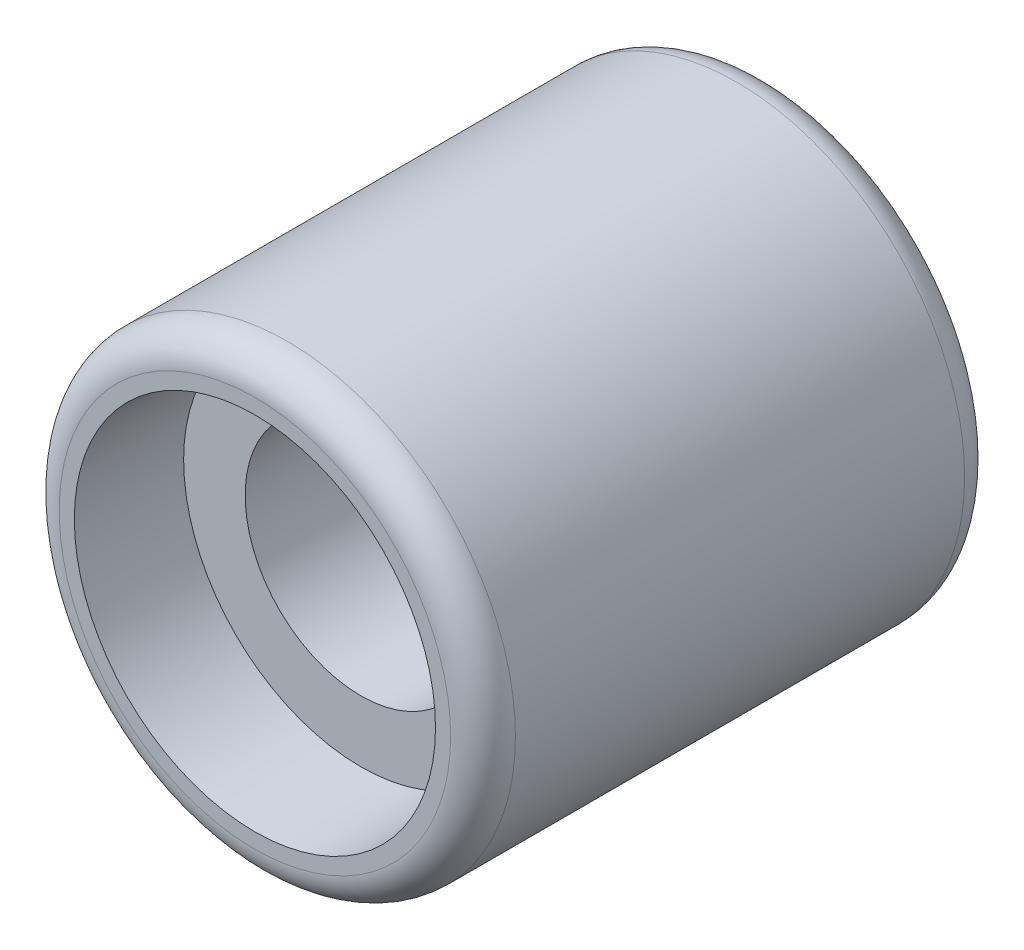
from build123d import *

# Parameters (mm, degrees)
BODYSCH_R  = 38.1
BODY_DEPTH = 42.926
FLOWSCH_R  = 19.33702
FLOW_DEPTH = 85.852
FILLET1_R  = 5.41274


with BuildPart() as part:
    # BodySch → Body (new, symmetric)
    with BuildSketch(Plane.XY):
        Circle(BODYSCH_R)
    extrude(amount=BODY_DEPTH, both=True)

    # FlowSch → Flow (cut)
    with BuildSketch(Plane.XY.offset(-42.926)):
        Circle(FLOWSCH_R)
    extrude(amount=FLOW_DEPTH, mode=Mode.SUBTRACT)

    # ThreadSch → Thread (revolve, cut)
    with BuildSketch(Plane(origin=(0, 0, 0), x_dir=(0, 0, -1), z_dir=(1, 0, 0))):
        Polygon((-25.2222, 0), (-25.2222, 29.611290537), (-42.926, 30.1625), (-42.926, 0), align=None)
    thread = revolve(axis=Axis((0, 0, 0), (0, 0, 1)), mode=Mode.SUBTRACT)

    # Fillet1
    fillet1_edges = [part.edges().sort_by_distance(p)[0] for p in [
        (-38.1, 0, -42.926),
        (-38.1, 0, 42.926),
    ]]
    fillet(fillet1_edges, radius=FILLET1_R)

    # Mirror1: Thread across plane
    add(thread.mirror(Plane.XY), mode=Mode.SUBTRACT)


solid = part.part
